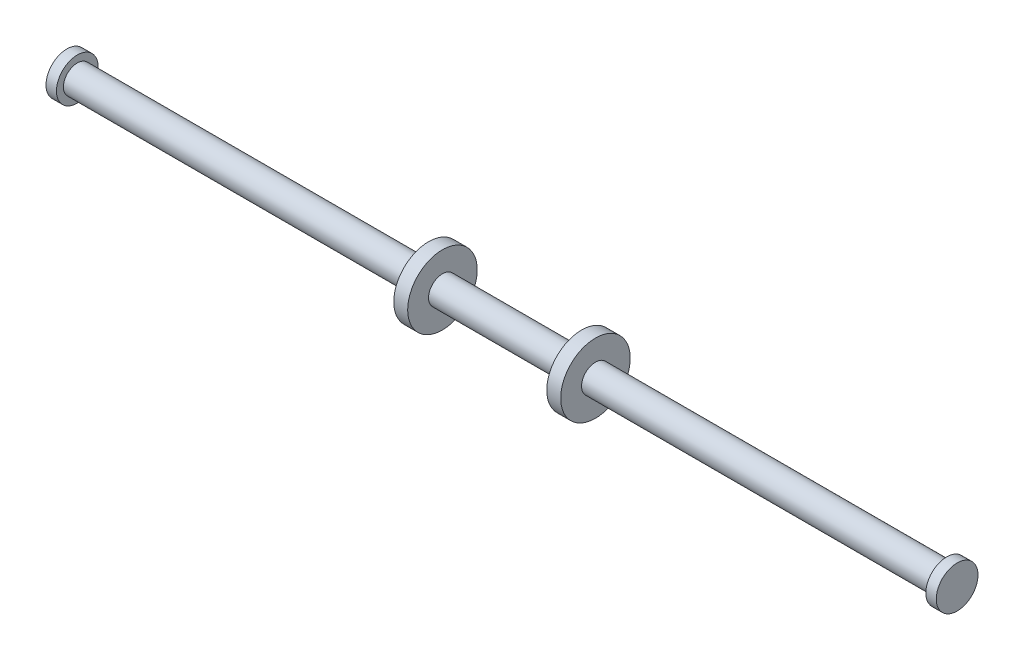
ISO-10303-21;
HEADER;
FILE_DESCRIPTION(('STEP AP214'),'2;1');
FILE_NAME('part.step','',(''),(''),'','','');
FILE_SCHEMA(('AUTOMOTIVE_DESIGN { 1 0 10303 214 1 1 1 1 }'));
ENDSEC;
DATA;
#1=APPLICATION_CONTEXT('core data for automotive mechanical design processes');
#2=APPLICATION_PROTOCOL_DEFINITION('international standard','automotive_design',2000,#1);
#3=PRODUCT_CONTEXT('',#1,'mechanical');
#4=PRODUCT('Part','Part','',(#3));
#5=PRODUCT_RELATED_PRODUCT_CATEGORY('part','',(#4));
#6=PRODUCT_DEFINITION_FORMATION('','',#4);
#7=PRODUCT_DEFINITION_CONTEXT('part definition',#1,'design');
#8=PRODUCT_DEFINITION('design','',#6,#7);
#9=PRODUCT_DEFINITION_SHAPE('','',#8);
#10=(LENGTH_UNIT() NAMED_UNIT(*) SI_UNIT(.MILLI.,.METRE.));
#11=(NAMED_UNIT(*) PLANE_ANGLE_UNIT() SI_UNIT($,.RADIAN.));
#12=(NAMED_UNIT(*) SI_UNIT($,.STERADIAN.) SOLID_ANGLE_UNIT());
#13=UNCERTAINTY_MEASURE_WITH_UNIT(LENGTH_MEASURE(1.E-05),#10,'distance_accuracy_value','');
#14=(GEOMETRIC_REPRESENTATION_CONTEXT(3) GLOBAL_UNCERTAINTY_ASSIGNED_CONTEXT((#13)) GLOBAL_UNIT_ASSIGNED_CONTEXT((#10,
#11,#12)) REPRESENTATION_CONTEXT('',''));
#15=CARTESIAN_POINT('',(0.,0.,0.));
#16=DIRECTION('',(0.,0.,1.));
#17=DIRECTION('',(1.,0.,0.));
#18=AXIS2_PLACEMENT_3D('',#15,#16,#17);
#19=CARTESIAN_POINT('',(128.,0.,0.));
#20=DIRECTION('',(-1.,0.,0.));
#21=DIRECTION('',(0.,0.,1.));
#22=AXIS2_PLACEMENT_3D('',#19,#20,#21);
#23=CYLINDRICAL_SURFACE('',#22,2.);
#24=CARTESIAN_POINT('',(54.,0.,0.));
#25=DIRECTION('',(-1.,0.,0.));
#26=DIRECTION('',(0.,0.,1.));
#27=AXIS2_PLACEMENT_3D('',#24,#25,#26);
#28=CIRCLE('',#27,2.);
#29=CARTESIAN_POINT('',(54.,0.,2.));
#30=VERTEX_POINT('',#29);
#31=EDGE_CURVE('E52',#30,#30,#28,.T.);
#32=ORIENTED_EDGE('',*,*,#31,.F.);
#33=EDGE_LOOP('',(#32));
#34=FACE_BOUND('',#33,.T.);
#35=CARTESIAN_POINT('',(74.,0.,0.));
#36=DIRECTION('',(1.,0.,0.));
#37=DIRECTION('',(0.,0.,-1.));
#38=AXIS2_PLACEMENT_3D('',#35,#36,#37);
#39=CIRCLE('',#38,2.);
#40=CARTESIAN_POINT('',(74.,0.,-2.));
#41=VERTEX_POINT('',#40);
#42=EDGE_CURVE('E10',#41,#41,#39,.T.);
#43=ORIENTED_EDGE('',*,*,#42,.F.);
#44=EDGE_LOOP('',(#43));
#45=FACE_BOUND('',#44,.T.);
#46=ADVANCED_FACE('F43',(#34,#45),#23,.T.);
#47=CARTESIAN_POINT('',(52.,0.,0.));
#48=DIRECTION('',(-1.,0.,0.));
#49=DIRECTION('',(0.,0.,1.));
#50=AXIS2_PLACEMENT_3D('',#47,#48,#49);
#51=CIRCLE('',#50,2.);
#52=CARTESIAN_POINT('',(52.,0.,2.));
#53=VERTEX_POINT('',#52);
#54=EDGE_CURVE('E60',#53,#53,#51,.T.);
#55=ORIENTED_EDGE('',*,*,#54,.T.);
#56=EDGE_LOOP('',(#55));
#57=FACE_BOUND('',#56,.T.);
#58=CARTESIAN_POINT('',(1.5,0.,0.));
#59=DIRECTION('',(-1.,0.,0.));
#60=DIRECTION('',(0.,0.,1.));
#61=AXIS2_PLACEMENT_3D('',#58,#59,#60);
#62=CIRCLE('',#61,2.);
#63=CARTESIAN_POINT('',(1.5,0.,2.));
#64=VERTEX_POINT('',#63);
#65=EDGE_CURVE('E57',#64,#64,#62,.T.);
#66=ORIENTED_EDGE('',*,*,#65,.F.);
#67=EDGE_LOOP('',(#66));
#68=FACE_BOUND('',#67,.T.);
#69=ADVANCED_FACE('F45',(#57,#68),#23,.T.);
#70=CARTESIAN_POINT('',(1.5,0.,0.));
#71=DIRECTION('',(-1.,0.,0.));
#72=DIRECTION('',(0.,0.,1.));
#73=AXIS2_PLACEMENT_3D('',#70,#71,#72);
#74=CYLINDRICAL_SURFACE('',#73,3.);
#75=CARTESIAN_POINT('',(1.5,0.,0.));
#76=DIRECTION('',(-1.,0.,0.));
#77=DIRECTION('',(0.,0.,1.));
#78=AXIS2_PLACEMENT_3D('',#75,#76,#77);
#79=CIRCLE('',#78,3.);
#80=CARTESIAN_POINT('',(1.5,0.,3.));
#81=VERTEX_POINT('',#80);
#82=EDGE_CURVE('E78',#81,#81,#79,.T.);
#83=ORIENTED_EDGE('',*,*,#82,.T.);
#84=EDGE_LOOP('',(#83));
#85=FACE_BOUND('',#84,.T.);
#86=CARTESIAN_POINT('',(0.,0.,0.));
#87=DIRECTION('',(-1.,0.,0.));
#88=DIRECTION('',(0.,0.,1.));
#89=AXIS2_PLACEMENT_3D('',#86,#87,#88);
#90=CIRCLE('',#89,3.);
#91=CARTESIAN_POINT('',(0.,0.,3.));
#92=VERTEX_POINT('',#91);
#93=EDGE_CURVE('E63',#92,#92,#90,.T.);
#94=ORIENTED_EDGE('',*,*,#93,.F.);
#95=EDGE_LOOP('',(#94));
#96=FACE_BOUND('',#95,.T.);
#97=ADVANCED_FACE('F131',(#85,#96),#74,.T.);
#98=CARTESIAN_POINT('',(1.5,0.,0.));
#99=DIRECTION('',(-1.,0.,0.));
#100=DIRECTION('',(0.,0.,1.));
#101=AXIS2_PLACEMENT_3D('',#98,#99,#100);
#102=PLANE('',#101);
#103=ORIENTED_EDGE('',*,*,#65,.T.);
#104=EDGE_LOOP('',(#103));
#105=FACE_BOUND('',#104,.T.);
#106=ORIENTED_EDGE('',*,*,#82,.F.);
#107=EDGE_LOOP('',(#106));
#108=FACE_BOUND('',#107,.T.);
#109=ADVANCED_FACE('F157',(#105,#108),#102,.F.);
#110=CARTESIAN_POINT('',(0.,0.,0.));
#111=DIRECTION('',(1.,0.,0.));
#112=DIRECTION('',(0.,0.,-1.));
#113=AXIS2_PLACEMENT_3D('',#110,#111,#112);
#114=PLANE('',#113);
#115=ORIENTED_EDGE('',*,*,#93,.T.);
#116=EDGE_LOOP('',(#115));
#117=FACE_BOUND('',#116,.T.);
#118=ADVANCED_FACE('F154',(#117),#114,.F.);
#119=CARTESIAN_POINT('',(52.,0.,0.));
#120=DIRECTION('',(1.,0.,0.));
#121=DIRECTION('',(0.,0.,-1.));
#122=AXIS2_PLACEMENT_3D('',#119,#120,#121);
#123=CYLINDRICAL_SURFACE('',#122,5.);
#124=CARTESIAN_POINT('',(52.,0.,0.));
#125=DIRECTION('',(-1.,0.,0.));
#126=DIRECTION('',(0.,0.,1.));
#127=AXIS2_PLACEMENT_3D('',#124,#125,#126);
#128=CIRCLE('',#127,5.);
#129=CARTESIAN_POINT('',(52.,0.,5.));
#130=VERTEX_POINT('',#129);
#131=EDGE_CURVE('E64',#130,#130,#128,.T.);
#132=ORIENTED_EDGE('',*,*,#131,.F.);
#133=EDGE_LOOP('',(#132));
#134=FACE_BOUND('',#133,.T.);
#135=CARTESIAN_POINT('',(54.,0.,0.));
#136=DIRECTION('',(-1.,0.,0.));
#137=DIRECTION('',(0.,0.,1.));
#138=AXIS2_PLACEMENT_3D('',#135,#136,#137);
#139=CIRCLE('',#138,5.);
#140=CARTESIAN_POINT('',(54.,0.,5.));
#141=VERTEX_POINT('',#140);
#142=EDGE_CURVE('E88',#141,#141,#139,.T.);
#143=ORIENTED_EDGE('',*,*,#142,.T.);
#144=EDGE_LOOP('',(#143));
#145=FACE_BOUND('',#144,.T.);
#146=ADVANCED_FACE('F156',(#134,#145),#123,.T.);
#147=CARTESIAN_POINT('',(52.,0.,0.));
#148=DIRECTION('',(-1.,0.,0.));
#149=DIRECTION('',(0.,0.,1.));
#150=AXIS2_PLACEMENT_3D('',#147,#148,#149);
#151=PLANE('',#150);
#152=ORIENTED_EDGE('',*,*,#54,.F.);
#153=EDGE_LOOP('',(#152));
#154=FACE_BOUND('',#153,.T.);
#155=ORIENTED_EDGE('',*,*,#131,.T.);
#156=EDGE_LOOP('',(#155));
#157=FACE_BOUND('',#156,.T.);
#158=ADVANCED_FACE('F163',(#154,#157),#151,.T.);
#159=CARTESIAN_POINT('',(54.,0.,0.));
#160=DIRECTION('',(-1.,0.,0.));
#161=DIRECTION('',(0.,0.,1.));
#162=AXIS2_PLACEMENT_3D('',#159,#160,#161);
#163=PLANE('',#162);
#164=ORIENTED_EDGE('',*,*,#31,.T.);
#165=EDGE_LOOP('',(#164));
#166=FACE_BOUND('',#165,.T.);
#167=ORIENTED_EDGE('',*,*,#142,.F.);
#168=EDGE_LOOP('',(#167));
#169=FACE_BOUND('',#168,.T.);
#170=ADVANCED_FACE('F122',(#166,#169),#163,.F.);
#171=CARTESIAN_POINT('',(76.,0.,0.));
#172=DIRECTION('',(-1.,0.,0.));
#173=DIRECTION('',(0.,0.,1.));
#174=AXIS2_PLACEMENT_3D('',#171,#172,#173);
#175=CYLINDRICAL_SURFACE('',#174,5.);
#176=CARTESIAN_POINT('',(76.,0.,0.));
#177=DIRECTION('',(1.,0.,0.));
#178=DIRECTION('',(0.,0.,-1.));
#179=AXIS2_PLACEMENT_3D('',#176,#177,#178);
#180=CIRCLE('',#179,5.);
#181=CARTESIAN_POINT('',(76.,0.,-5.));
#182=VERTEX_POINT('',#181);
#183=EDGE_CURVE('E99',#182,#182,#180,.T.);
#184=ORIENTED_EDGE('',*,*,#183,.F.);
#185=EDGE_LOOP('',(#184));
#186=FACE_BOUND('',#185,.T.);
#187=CARTESIAN_POINT('',(74.,0.,0.));
#188=DIRECTION('',(1.,0.,0.));
#189=DIRECTION('',(0.,0.,-1.));
#190=AXIS2_PLACEMENT_3D('',#187,#188,#189);
#191=CIRCLE('',#190,5.);
#192=CARTESIAN_POINT('',(74.,0.,-5.));
#193=VERTEX_POINT('',#192);
#194=EDGE_CURVE('E95',#193,#193,#191,.T.);
#195=ORIENTED_EDGE('',*,*,#194,.T.);
#196=EDGE_LOOP('',(#195));
#197=FACE_BOUND('',#196,.T.);
#198=ADVANCED_FACE('F114',(#186,#197),#175,.T.);
#199=CARTESIAN_POINT('',(76.,0.,0.));
#200=DIRECTION('',(1.,0.,0.));
#201=DIRECTION('',(0.,0.,-1.));
#202=AXIS2_PLACEMENT_3D('',#199,#200,#201);
#203=PLANE('',#202);
#204=CARTESIAN_POINT('',(76.,0.,0.));
#205=DIRECTION('',(1.,0.,0.));
#206=DIRECTION('',(0.,0.,-1.));
#207=AXIS2_PLACEMENT_3D('',#204,#205,#206);
#208=CIRCLE('',#207,2.);
#209=CARTESIAN_POINT('',(76.,0.,-2.));
#210=VERTEX_POINT('',#209);
#211=EDGE_CURVE('E47',#210,#210,#208,.T.);
#212=ORIENTED_EDGE('',*,*,#211,.F.);
#213=EDGE_LOOP('',(#212));
#214=FACE_BOUND('',#213,.T.);
#215=ORIENTED_EDGE('',*,*,#183,.T.);
#216=EDGE_LOOP('',(#215));
#217=FACE_BOUND('',#216,.T.);
#218=ADVANCED_FACE('F111',(#214,#217),#203,.T.);
#219=CARTESIAN_POINT('',(74.,0.,0.));
#220=DIRECTION('',(1.,0.,0.));
#221=DIRECTION('',(0.,0.,-1.));
#222=AXIS2_PLACEMENT_3D('',#219,#220,#221);
#223=PLANE('',#222);
#224=ORIENTED_EDGE('',*,*,#42,.T.);
#225=EDGE_LOOP('',(#224));
#226=FACE_BOUND('',#225,.T.);
#227=ORIENTED_EDGE('',*,*,#194,.F.);
#228=EDGE_LOOP('',(#227));
#229=FACE_BOUND('',#228,.T.);
#230=ADVANCED_FACE('F113',(#226,#229),#223,.F.);
#231=CARTESIAN_POINT('',(128.,0.,0.));
#232=DIRECTION('',(1.,0.,0.));
#233=DIRECTION('',(0.,0.,-1.));
#234=AXIS2_PLACEMENT_3D('',#231,#232,#233);
#235=PLANE('',#234);
#236=CARTESIAN_POINT('',(128.,0.,0.));
#237=DIRECTION('',(1.,0.,0.));
#238=DIRECTION('',(0.,0.,-1.));
#239=AXIS2_PLACEMENT_3D('',#236,#237,#238);
#240=CIRCLE('',#239,3.);
#241=CARTESIAN_POINT('',(128.,0.,-3.));
#242=VERTEX_POINT('',#241);
#243=EDGE_CURVE('E74',#242,#242,#240,.T.);
#244=ORIENTED_EDGE('',*,*,#243,.T.);
#245=EDGE_LOOP('',(#244));
#246=FACE_BOUND('',#245,.T.);
#247=ADVANCED_FACE('F120',(#246),#235,.T.);
#248=CARTESIAN_POINT('',(126.5,0.,0.));
#249=DIRECTION('',(1.,0.,0.));
#250=DIRECTION('',(0.,0.,-1.));
#251=AXIS2_PLACEMENT_3D('',#248,#249,#250);
#252=CYLINDRICAL_SURFACE('',#251,3.);
#253=CARTESIAN_POINT('',(126.5,0.,0.));
#254=DIRECTION('',(1.,0.,0.));
#255=DIRECTION('',(0.,0.,-1.));
#256=AXIS2_PLACEMENT_3D('',#253,#254,#255);
#257=CIRCLE('',#256,3.);
#258=CARTESIAN_POINT('',(126.5,0.,-3.));
#259=VERTEX_POINT('',#258);
#260=EDGE_CURVE('E73',#259,#259,#257,.T.);
#261=ORIENTED_EDGE('',*,*,#260,.T.);
#262=EDGE_LOOP('',(#261));
#263=FACE_BOUND('',#262,.T.);
#264=ORIENTED_EDGE('',*,*,#243,.F.);
#265=EDGE_LOOP('',(#264));
#266=FACE_BOUND('',#265,.T.);
#267=ADVANCED_FACE('F140',(#263,#266),#252,.T.);
#268=CARTESIAN_POINT('',(126.5,0.,0.));
#269=DIRECTION('',(1.,0.,0.));
#270=DIRECTION('',(0.,0.,-1.));
#271=AXIS2_PLACEMENT_3D('',#268,#269,#270);
#272=PLANE('',#271);
#273=CARTESIAN_POINT('',(126.5,0.,0.));
#274=DIRECTION('',(1.,0.,0.));
#275=DIRECTION('',(0.,0.,-1.));
#276=AXIS2_PLACEMENT_3D('',#273,#274,#275);
#277=CIRCLE('',#276,2.);
#278=CARTESIAN_POINT('',(126.5,0.,-2.));
#279=VERTEX_POINT('',#278);
#280=EDGE_CURVE('E69',#279,#279,#277,.T.);
#281=ORIENTED_EDGE('',*,*,#280,.T.);
#282=EDGE_LOOP('',(#281));
#283=FACE_BOUND('',#282,.T.);
#284=ORIENTED_EDGE('',*,*,#260,.F.);
#285=EDGE_LOOP('',(#284));
#286=FACE_BOUND('',#285,.T.);
#287=ADVANCED_FACE('F136',(#283,#286),#272,.F.);
#288=ORIENTED_EDGE('',*,*,#211,.T.);
#289=EDGE_LOOP('',(#288));
#290=FACE_BOUND('',#289,.T.);
#291=ORIENTED_EDGE('',*,*,#280,.F.);
#292=EDGE_LOOP('',(#291));
#293=FACE_BOUND('',#292,.T.);
#294=ADVANCED_FACE('F108',(#290,#293),#23,.T.);
#295=CLOSED_SHELL('',(#46,#69,#97,#109,#118,#146,#158,#170,#198,#218,#230,#247,#267,#287,#294));
#296=MANIFOLD_SOLID_BREP('B2',#295);
#297=ADVANCED_BREP_SHAPE_REPRESENTATION('',(#18,#296),#14);
#298=SHAPE_DEFINITION_REPRESENTATION(#9,#297);
ENDSEC;
END-ISO-10303-21;
